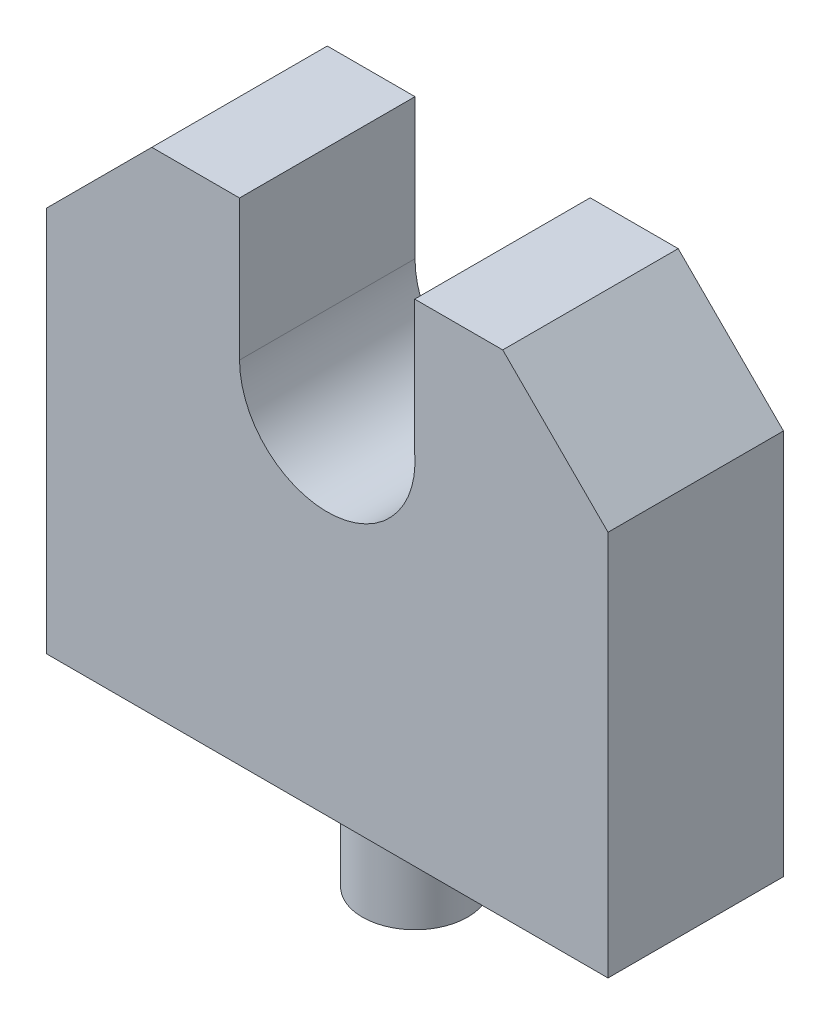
from build123d import *

# Parameters (mm, degrees)
SKETCH_1_W          = 160
SKETCH_1_H          = 140
EXTRUDE_1_DEPTH     = 50
SKETCH_2_R          = 25
CUT_EXTRUDE_2_DEPTH = 219.403296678
SKETCH_3_W          = 49.916562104
SKETCH_3_H          = 40
CUT_EXTRUDE_3_DEPTH = 219.403296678
SKETCH_4_R          = 15
EXTRUDE_4_DEPTH     = 30
CHAMFER_1_SIZE      = 30


with BuildPart() as part:
    # Sketch 1 → Extrude 1 (new body)
    with BuildSketch(Plane.XY):
        with Locations((80, 70)):
            Rectangle(SKETCH_1_W, SKETCH_1_H)
    extrude(amount=EXTRUDE_1_DEPTH)

    # Sketch 2 → Cut-Extrude 2 (cut, through all)
    with BuildSketch(Plane.XY.offset(50)):
        with Locations((80, 100)):
            Circle(SKETCH_2_R)
    extrude(amount=-CUT_EXTRUDE_2_DEPTH, mode=Mode.SUBTRACT)

    # Sketch 3 → Cut-Extrude 3 (cut, through all)
    with BuildSketch(Plane.XY.offset(50)):
        with Locations((79.958281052, 120)):
            Rectangle(SKETCH_3_W, SKETCH_3_H)
    extrude(amount=-CUT_EXTRUDE_3_DEPTH, mode=Mode.SUBTRACT)

    # Sketch 4 → Extrude 4 (add)
    with BuildSketch(Plane.XZ):
        with Locations(Location((80, 25, 0), (0, 0, 90))):
            Circle(SKETCH_4_R)
    extrude(amount=EXTRUDE_4_DEPTH)

    # Chamfer 1
    chamfer_1_edges = [part.edges().sort_by_distance(p)[0] for p in [
        (0, 140, 25),
        (160, 140, 25),
    ]]
    chamfer(chamfer_1_edges, length=CHAMFER_1_SIZE)


solid = part.part
